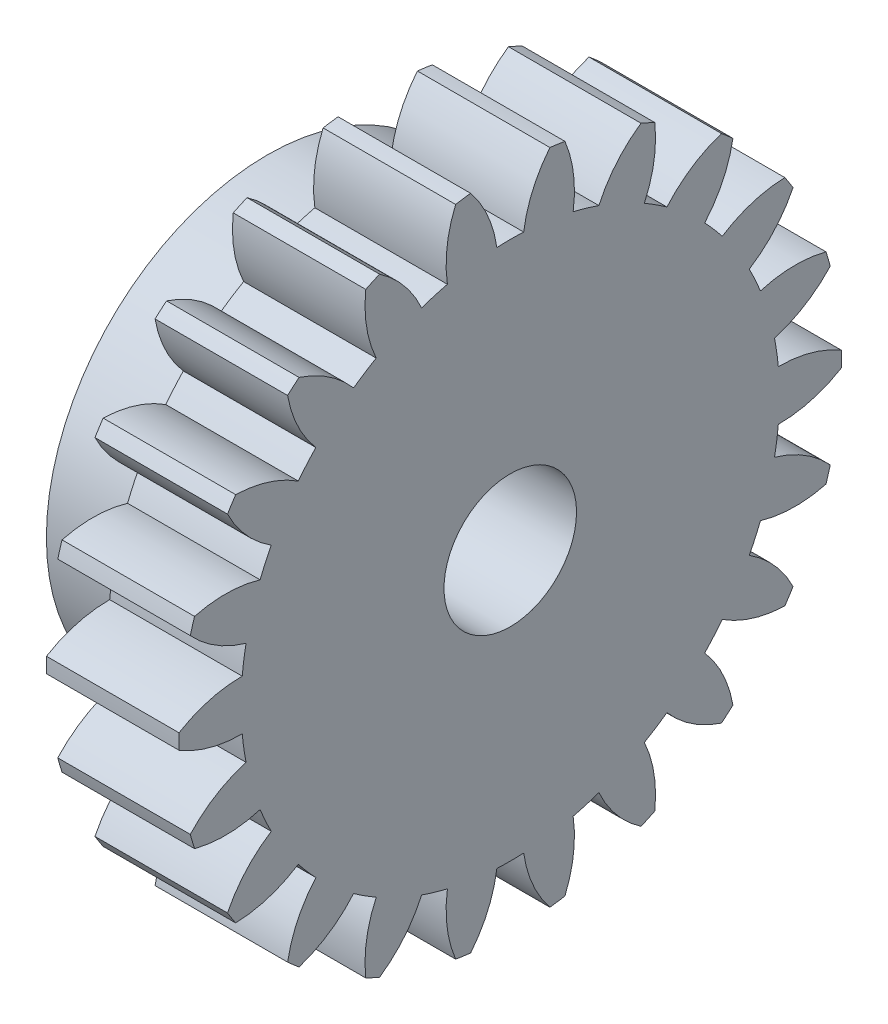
from build123d import *

# Parameters (mm, degrees)
SKETCH1_R           = 30
BOSS_EXTRUDE1_DEPTH = 12
CUT_EXTRUDE1_DEPTH  = 12
CIRPATTERN1_COUNT   = 22
SKETCH4_R           = 20
BOSS_EXTRUDE2_DEPTH = 10
SKETCH5_R           = 6
CUT_EXTRUDE2_DEPTH  = 48.656236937


with BuildPart() as part:
    # Sketch1 → Boss-Extrude1 (new body)
    with BuildSketch(Plane(origin=(0, 0, 0), x_dir=(0, 0, -1), z_dir=(1, 0, 0))):
        Circle(SKETCH1_R)
    extrude(amount=BOSS_EXTRUDE1_DEPTH)

    # Sketch2 → Cut-Extrude1 (cut)
    with BuildSketch(Plane(origin=(12, 0, 0), x_dir=(0, 0, -1), z_dir=(1, 0, 0))):
        with BuildLine():
            ThreePointArc((1.215293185, 24.343683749), (0, 24.374), (-1.215293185, 24.343683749))
            ThreePointArc((-1.215293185, 24.343683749), (-2.034367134, 27.241050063), (-3.608361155, 29.807790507))
            ThreePointArc((-3.608361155, 29.807790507), (0, 30.0254), (3.608361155, 29.807790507))
            ThreePointArc((3.608361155, 29.807790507), (2.034367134, 27.241050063), (1.215293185, 24.343683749))
        make_face()
    cut_extrude1 = extrude(amount=-CUT_EXTRUDE1_DEPTH, mode=Mode.SUBTRACT)

    # CirPattern1: Cut-Extrude1 ×22 about axis
    cirpattern1_axis = Axis((0, 0, 0), (1, 0, 0))
    for i in range(1, CIRPATTERN1_COUNT):
        add(cut_extrude1.rotate(cirpattern1_axis, i * 360 / CIRPATTERN1_COUNT), mode=Mode.SUBTRACT)

    # Sketch4 → Boss-Extrude2 (add)
    with BuildSketch(Plane.ZY):
        with Locations(Location((0, 0, 0), (0, 0, 180))):
            Circle(SKETCH4_R)
    extrude(amount=BOSS_EXTRUDE2_DEPTH)

    # Sketch5 → Cut-Extrude2 (cut, through all)
    with BuildSketch(Plane(origin=(12, 0, 0), x_dir=(0, 0, -1), z_dir=(1, 0, 0))):
        Circle(SKETCH5_R)
    extrude(amount=-CUT_EXTRUDE2_DEPTH, mode=Mode.SUBTRACT)


solid = part.part
